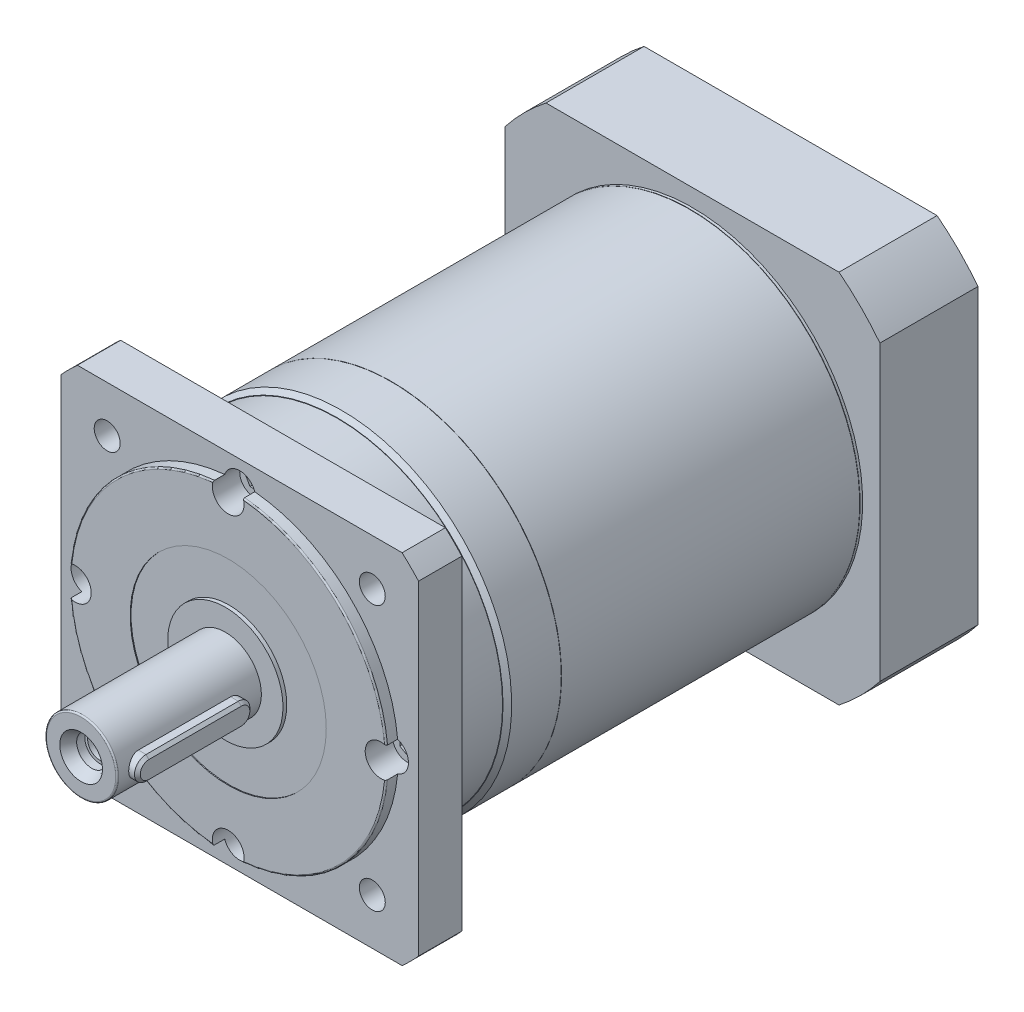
from build123d import *

# Parameters (mm, degrees)
SKETCH_1_R               = 59
EXTRUDE_1_DEPTH          = 56.5
SKETCH_2_OUTSIDE_W       = 155.236
SKETCH_2_OUTSIDE_H       = 155.236
SKETCH_2_OUTSIDE_R       = 55
CUT_EXTRUDE_1_DEPTH      = 4
SKETCH_4_R               = 59
EXTRUDE_2_DEPTH          = 103.4
SKETCH_5_R               = 59
EXTRUDE_3_DEPTH          = 0.9
EXTRUDE_4_DEPTH          = 34
CUT_EXTRUDE_START        = -8
SKETCH_7_R               = 55
CUT_EXTRUDE_3_DEPTH      = 8
SKETCH_8_R               = 39
CUT_EXTRUDE_4_DEPTH      = 30
SKETCH_9_R               = 5.5
CUT_EXTRUDE_5_DEPTH      = 18
PATTERN_CIRCULAR_1_COUNT = 6
PATTERN_CIRCULAR_2_COUNT = 4
FILLET_1_R               = 0.5
SKETCH_12_R              = 20
EXTRUDE_5_DEPTH          = 1
SKETCH_13_R              = 12.5
EXTRUDE_6_DEPTH          = 50
FILLET_2_R               = 0.5
SKETCH_14_R              = 5.5
CUT_EXTRUDE_6_DEPTH      = 11
PATTERN_CIRCULAR_3_COUNT = 4
SKETCH_15_R              = 5
EXTRUDE_7_DEPTH          = 6
PATTERN_CIRCULAR_4_COUNT = 4
SKETCH_16_R              = 5
EXTRUDE_8_DEPTH          = 6
PATTERN_CIRCULAR_5_COUNT = 6
SKETCH_17_R              = 32.5
EXTRUDE_9_DEPTH          = 23
CHAMFER_2_SIZE           = 1
SKETCH_18_W              = 71.157450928
SKETCH_18_H              = 1
CUT_EXTRUDE_7_DEPTH      = 23
SKETCH_19_R              = 11
CUT_EXTRUDE_8_DEPTH      = 59
EXTRUDE_10_DEPTH         = 15.5
CHAMFER_3_SIZE           = 1
EXTRUDE_START            = -15
SKETCH_23_R              = 59
EXTRUDE_11_DEPTH         = 15
SKETCH_24_OUTSIDE_W      = 193.422
SKETCH_24_OUTSIDE_H      = 193.422
SKETCH_24_OUTSIDE_R      = 57.35
CUT_EXTRUDE_9_DEPTH      = 18.8
CHAMFER_4_SIZE           = 1.5
SKETCH_25_R              = 4.5
CUT_EXTRUDE_10_DEPTH     = 18.8
PATTERN_CIRCULAR_6_COUNT = 4
SKETCH_27_R              = 5.5
CUT_EXTRUDE_11_DEPTH     = 4
PATTERN_CIRCULAR_7_COUNT = 4
CUT_EXTRUDE_START_2      = -0.3
SKETCH_28_R              = 34
SKETCH_28_R_2            = 20
CUT_EXTRUDE_12_DEPTH     = 0.3
SKETCH_29_R              = 5.25
CUT_EXTRUDE_13_DEPTH     = 6.5
SKETCH_31_R              = 7.4
SKETCH_30_R              = 5.25


with BuildPart() as part:
    # Sketch 1 → Extrude 1 (new body)
    with BuildSketch(Plane.XY):
        Circle(SKETCH_1_R)
    extrude(amount=EXTRUDE_1_DEPTH)

    # Sketch 2 outside → Cut-Extrude 1 (cut)
    with BuildSketch(Plane.XY.offset(56.5)):
        Rectangle(SKETCH_2_OUTSIDE_W, SKETCH_2_OUTSIDE_H)
        Circle(SKETCH_2_OUTSIDE_R, mode=Mode.SUBTRACT)
    extrude(amount=-CUT_EXTRUDE_1_DEPTH, mode=Mode.SUBTRACT)

    # Fillet 1
    fillet_1_edges = [part.edges().sort_by_distance(p)[0] for p in [
        (-55, 0, 56.5),
    ]]
    fillet(fillet_1_edges, radius=FILLET_1_R)

    # Sketch 12 → Extrude 5 (add)
    with BuildSketch(Plane.XY.offset(56.5)):
        Circle(SKETCH_12_R)
    extrude(amount=EXTRUDE_5_DEPTH)

    # Sketch 13 → Extrude 6 (add)
    with BuildSketch(Plane.XY.offset(57.5)):
        Circle(SKETCH_13_R)
    extrude(amount=EXTRUDE_6_DEPTH)

    # Fillet 2
    fillet_2_edges = [part.edges().sort_by_distance(p)[0] for p in [
        (-12.5, 0, 107.5),
    ]]
    fillet(fillet_2_edges, radius=FILLET_2_R)

    # Sketch 14 → Cut-Extrude 6 (cut)
    with BuildSketch(Plane.XY.offset(52.5)):
        with Locations((0, -53)):
            Circle(SKETCH_14_R)
    cut_extrude_6 = extrude(amount=-CUT_EXTRUDE_6_DEPTH, mode=Mode.SUBTRACT)

    # Pattern Circular 3: Cut-Extrude 6 ×4 about axis
    pattern_circular_3_axis = Axis((0, 0, 0), (0, 0, 1))
    for i in range(1, PATTERN_CIRCULAR_3_COUNT):
        add(cut_extrude_6.rotate(pattern_circular_3_axis, i * 360 / PATTERN_CIRCULAR_3_COUNT), mode=Mode.SUBTRACT)

    # Sketch 15 → Extrude 7 (add)
    with BuildSketch(Plane.XY.offset(41.5)):
        with Locations((0, -53)):
            Circle(SKETCH_15_R)
        Polygon((1.459547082, -50.509406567), (-1.427143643, -50.490698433), (-2.886690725, -52.981291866), (-1.459547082, -55.490593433), (1.427143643, -55.509301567), (2.886690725, -53.018708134), align=None, mode=Mode.SUBTRACT)
    extrude_7 = extrude(amount=EXTRUDE_7_DEPTH)

    # Pattern Circular 4: Extrude 7 ×4 about axis
    pattern_circular_4_axis = Axis((0, 0, 0), (0, 0, 1))
    for i in range(1, PATTERN_CIRCULAR_4_COUNT):
        add(extrude_7.rotate(pattern_circular_4_axis, i * 360 / PATTERN_CIRCULAR_4_COUNT))

    # Sketch 22 → Extrude 10 (add)
    with BuildSketch(Plane(origin=(0, 0, 0), x_dir=(0, 0, -1), z_dir=(1, 0, 0))):
        with BuildLine():
            Line((-99.5, 4), (-67.5, 4))
            ThreePointArc((-67.5, 4), (-63.5, 0), (-67.5, -4))
            Line((-67.5, -4), (-99.5, -4))
            ThreePointArc((-99.5, -4), (-103.5, 0), (-99.5, 4))
        make_face()
    extrude(amount=EXTRUDE_10_DEPTH)

    # Chamfer 3
    chamfer_3_edges = [part.edges().sort_by_distance(p)[0] for p in [
        (15.5, 0, 103.5),
        (15.5, -4, 83.5),
        (15.5, 0, 63.5),
        (15.5, 4, 83.5),
    ]]
    chamfer(chamfer_3_edges, length=CHAMFER_3_SIZE)

    # Sketch 23 → Extrude 11 (add)
    with BuildSketch(Plane.XY.offset(52.5).offset(EXTRUDE_START)):
        with BuildLine():
            Line((-56.303308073, 62), (56.303308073, 62))
            ThreePointArc((56.303308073, 62), (59.220192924, 59.220192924), (62, 56.303308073))
            Line((62, 56.303308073), (62, -56.303308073))
            ThreePointArc((62, -56.303308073), (59.220192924, -59.220192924), (56.303308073, -62))
            Line((56.303308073, -62), (-56.303308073, -62))
            ThreePointArc((-56.303308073, -62), (-59.220192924, -59.220192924), (-62, -56.303308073))
            Line((-62, -56.303308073), (-62, 56.303308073))
            ThreePointArc((-62, 56.303308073), (-59.220192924, 59.220192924), (-56.303308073, 62))
        make_face()
        with Locations(Location((0, 0, 0), (0, 0, 180))):
            Circle(SKETCH_23_R, mode=Mode.SUBTRACT)
    extrude(amount=EXTRUDE_11_DEPTH)

    # Sketch 24 outside → Cut-Extrude 9 (cut)
    with BuildSketch(Plane(origin=(0, 0, 37.5), x_dir=(-1, 0, 0), z_dir=(0, 0, -1))):
        Rectangle(SKETCH_24_OUTSIDE_W, SKETCH_24_OUTSIDE_H)
        Circle(SKETCH_24_OUTSIDE_R, mode=Mode.SUBTRACT)
    extrude(amount=CUT_EXTRUDE_9_DEPTH, mode=Mode.SUBTRACT)

    # Chamfer 4
    chamfer_4_edges = [part.edges().sort_by_distance(p)[0] for p in [
        (-59, 0, 18.7),
    ]]
    chamfer(chamfer_4_edges, length=CHAMFER_4_SIZE)

    # Sketch 25 → Cut-Extrude 10 (cut)
    with BuildSketch(Plane.XY.offset(52.5)):
        with Locations((-45.961940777, 45.961940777)):
            Circle(SKETCH_25_R)
    cut_extrude_10 = extrude(amount=-CUT_EXTRUDE_10_DEPTH, mode=Mode.SUBTRACT)

    # Pattern Circular 6: Cut-Extrude 10 ×4 about axis
    pattern_circular_6_axis = Axis((0, 0, 0), (0, 0, 1))
    for i in range(1, PATTERN_CIRCULAR_6_COUNT):
        add(cut_extrude_10.rotate(pattern_circular_6_axis, i * 360 / PATTERN_CIRCULAR_6_COUNT), mode=Mode.SUBTRACT)

    # Sketch 27 → Cut-Extrude 11 (cut)
    with BuildSketch(Plane.XY.offset(56.5)):
        with Locations(Location((-53, 0, 0), (0, 0, 270))):
            Circle(SKETCH_27_R)
    cut_extrude_11 = extrude(amount=-CUT_EXTRUDE_11_DEPTH, mode=Mode.SUBTRACT)

    # Pattern Circular 7: Cut-Extrude 11 ×4 about axis
    pattern_circular_7_axis = Axis((0, 0, 52.5), (0, 0, 1))
    for i in range(1, PATTERN_CIRCULAR_7_COUNT):
        add(cut_extrude_11.rotate(pattern_circular_7_axis, i * 360 / PATTERN_CIRCULAR_7_COUNT), mode=Mode.SUBTRACT)

    # Sketch 28 → Cut-Extrude 12 (cut)
    with BuildSketch(Plane.XY.offset(56.5).offset(CUT_EXTRUDE_START_2)):
        Circle(SKETCH_28_R)
        Circle(SKETCH_28_R_2, mode=Mode.SUBTRACT)
    extrude(amount=CUT_EXTRUDE_12_DEPTH, mode=Mode.SUBTRACT)

    # Sketch 29 → Cut-Extrude 13 (cut)
    with BuildSketch(Plane.XY.offset(107.5)):
        Circle(SKETCH_29_R)
    extrude(amount=-CUT_EXTRUDE_13_DEPTH, mode=Mode.SUBTRACT)

    # Sketch 31 → Loft 1 section 0
    with BuildSketch(Plane.XY.offset(107.5)):
        Circle(SKETCH_31_R)
    # Sketch 30 → Loft 1 section 1
    with BuildSketch(Plane.XY.offset(103.8)):
        Circle(SKETCH_30_R)
    loft(mode=Mode.SUBTRACT)

    # Sketch 32 → Hole Wizard M10 _1 (revolve, cut)
    with BuildSketch(Plane(origin=(0, 0, 101), x_dir=(0, -1, 0), z_dir=(1, 0, 0))):
        Polygon((0, 0), (0, 26.553657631), (4.25, 24), (4.25, 0), align=None)
    revolve(axis=Axis((0, 0, 107.35), (0, 0, -1)), mode=Mode.SUBTRACT)


with BuildPart() as body_2:
    # Sketch 4 → Extrude 2 (new body)
    with BuildSketch(Plane(origin=(0, 0, -0.1), x_dir=(-1, 0, 0), z_dir=(0, 0, -1))):
        Circle(SKETCH_4_R)
    extrude(amount=EXTRUDE_2_DEPTH)


with BuildPart() as body_3:
    # Sketch 5 → Extrude 3 (new body)
    with BuildSketch(Plane(origin=(0, 0, -103.6), x_dir=(-1, 0, 0), z_dir=(0, 0, -1))):
        Circle(SKETCH_5_R)
    extrude(amount=EXTRUDE_3_DEPTH)

    # Sketch 6 → Extrude 4 (add)
    with BuildSketch(Plane(origin=(0, 0, -104.5), x_dir=(-1, 0, 0), z_dir=(0, 0, -1))):
        with BuildLine():
            Line((-50.806003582, 65), (50.806003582, 65))
            ThreePointArc((50.806003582, 65), (58.336309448, 58.336309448), (65, 50.806003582))
            Line((65, 50.806003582), (65, -50.806003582))
            ThreePointArc((65, -50.806003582), (58.336309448, -58.336309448), (50.806003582, -65))
            Line((50.806003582, -65), (-50.806003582, -65))
            ThreePointArc((-50.806003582, -65), (-58.336309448, -58.336309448), (-65, -50.806003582))
            Line((-65, -50.806003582), (-65, 50.806003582))
            ThreePointArc((-65, 50.806003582), (-58.336309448, 58.336309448), (-50.806003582, 65))
        make_face()
    extrude(amount=EXTRUDE_4_DEPTH)

    # Sketch 7 → Cut-Extrude 3 (cut)
    with BuildSketch(Plane(origin=(0, 0, -138.5), x_dir=(-1, 0, 0), z_dir=(0, 0, -1)).offset(CUT_EXTRUDE_START)):
        Circle(SKETCH_7_R)
    extrude(amount=CUT_EXTRUDE_3_DEPTH, mode=Mode.SUBTRACT)


with BuildPart() as cut_extrude_4_tool:
    # Sketch 8 → Cut-Extrude 4 (new body)
    with BuildSketch(Plane(origin=(0, 0, -130.5), x_dir=(-1, 0, 0), z_dir=(0, 0, -1))):
        Circle(SKETCH_8_R)
    extrude(amount=-CUT_EXTRUDE_4_DEPTH)


with BuildPart() as body_2_1:
    add(body_2.part)

    # Cut-Extrude 4: cut by cut_extrude_4_tool
    add(cut_extrude_4_tool.part, mode=Mode.SUBTRACT)

    # Sketch 17 → Extrude 9 (add)
    with BuildSketch(Plane(origin=(0, 0, -123.5), x_dir=(-1, 0, 0), z_dir=(0, 0, -1))):
        Circle(SKETCH_17_R)
    extrude(amount=-EXTRUDE_9_DEPTH)

    # Chamfer 2
    chamfer_2_edges = [body_2_1.edges().sort_by_distance(p)[0] for p in [
        (32.5, 0, -123.5),
    ]]
    chamfer(chamfer_2_edges, length=CHAMFER_2_SIZE)

    # Sketch 18 → Cut-Extrude 7 (cut)
    with BuildSketch(Plane(origin=(0, 0, -123.5), x_dir=(-1, 0, 0), z_dir=(0, 0, -1))):
        with Locations((-0.10695181, 0)):
            Rectangle(SKETCH_18_W, SKETCH_18_H)
    extrude(amount=-CUT_EXTRUDE_7_DEPTH, mode=Mode.SUBTRACT)

    # Sketch 19 → Cut-Extrude 8 (cut)
    with BuildSketch(Plane(origin=(0, 0, -138.5), x_dir=(-1, 0, 0), z_dir=(0, 0, -1))):
        Circle(SKETCH_19_R)
    extrude(amount=-CUT_EXTRUDE_8_DEPTH, mode=Mode.SUBTRACT)


with BuildPart() as body_3_1:
    add(body_3.part)

    # Cut-Extrude 4: cut by cut_extrude_4_tool
    add(cut_extrude_4_tool.part, mode=Mode.SUBTRACT)

    # Sketch 9 → Cut-Extrude 5 (cut)
    with BuildSketch(Plane(origin=(0, 0, -138.5), x_dir=(-1, 0, 0), z_dir=(0, 0, -1))):
        with Locations((-53.5, 0)):
            Circle(SKETCH_9_R)
    cut_extrude_5 = extrude(amount=-CUT_EXTRUDE_5_DEPTH, mode=Mode.SUBTRACT)

    # Pattern Circular 1: Cut-Extrude 5 ×6 about axis
    pattern_circular_1_axis = Axis((0, 0, 0), (0, 0, 1))
    for i in range(1, PATTERN_CIRCULAR_1_COUNT):
        add(cut_extrude_5.rotate(pattern_circular_1_axis, i * 360 / PATTERN_CIRCULAR_1_COUNT), mode=Mode.SUBTRACT)

    # Sketch 11 → Hole Wizard M8 _1 (revolve, cut)
    with BuildSketch(Plane(origin=(51.265241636, 51.265241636, -138.5), x_dir=(0, 1, 0), z_dir=(1, 0, 0))):
        Polygon((0, 0), (0, 32.042926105), (3.4, 30), (3.4, 0), align=None)
    hole_wizard_m8_1 = revolve(axis=Axis((51.265241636, 51.265241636, -144.85), (0, 0, 1)), mode=Mode.SUBTRACT)

    # Pattern Circular 2: Hole Wizard M8 _1 ×4 about axis
    pattern_circular_2_axis = Axis((0, 0, 0), (0, 0, 1))
    for i in range(1, PATTERN_CIRCULAR_2_COUNT):
        add(hole_wizard_m8_1.rotate(pattern_circular_2_axis, i * 360 / PATTERN_CIRCULAR_2_COUNT), mode=Mode.SUBTRACT)

    # Sketch 16 → Extrude 8 (add)
    with BuildSketch(Plane(origin=(0, 0, -120.5), x_dir=(-1, 0, 0), z_dir=(0, 0, -1))):
        with Locations((-53.5, 0)):
            Circle(SKETCH_16_R)
        Polygon((-51.865292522, 2.379299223), (-54.743179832, 2.605347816), (-56.37788731, 0.226048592), (-55.134707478, -2.379299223), (-52.256820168, -2.605347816), (-50.62211269, -0.226048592), align=None, mode=Mode.SUBTRACT)
    extrude_8 = extrude(amount=EXTRUDE_8_DEPTH)

    # Pattern Circular 5: Extrude 8 ×6 about axis
    pattern_circular_5_axis = Axis((0, 0, 0), (0, 0, 1))
    for i in range(1, PATTERN_CIRCULAR_5_COUNT):
        add(extrude_8.rotate(pattern_circular_5_axis, i * 360 / PATTERN_CIRCULAR_5_COUNT))


solid = Compound([part.part, body_2_1.part, body_3_1.part])
